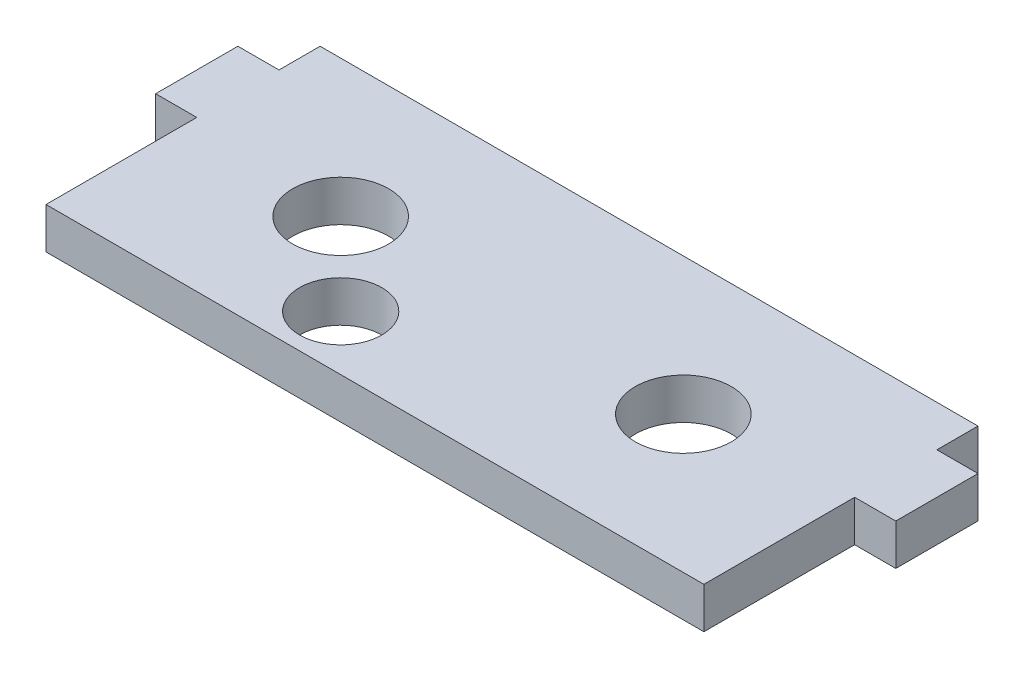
from build123d import *

# Parameters (mm, degrees)
SKETCH1_W           = 48
SKETCH1_H           = 20
BOSS_EXTRUDE1_DEPTH = 3
SKETCH2_W           = 3
SKETCH2_H           = 6
BOSS_EXTRUDE2_DEPTH = 3
SKETCH3_R           = 3
SKETCH3_R_2         = 3.5
CUT_EXTRUDE1_DEPTH  = 3


with BuildPart() as part:
    # Sketch1 → Boss-Extrude1 (new body)
    with BuildSketch(Plane(origin=(0, 0, 0), x_dir=(1, 0, 0), z_dir=(0, 1, 0))):
        Rectangle(SKETCH1_W, SKETCH1_H)
    extrude(amount=BOSS_EXTRUDE1_DEPTH)

    # Sketch2 → Boss-Extrude2 (add)
    with BuildSketch(Plane(origin=(0, 0, 0), x_dir=(1, 0, 0), z_dir=(0, 1, 0))):
        with Locations((-25.5, 4)):
            Rectangle(SKETCH2_W, SKETCH2_H)
        with Locations((25.5, 4)):
            Rectangle(SKETCH2_W, SKETCH2_H)
    extrude(amount=BOSS_EXTRUDE2_DEPTH)

    # Sketch3 → Cut-Extrude1 (cut)
    with BuildSketch(Plane(origin=(0, 0, 0), x_dir=(1, 0, 0), z_dir=(0, 1, 0))):
        with Locations(Location((-6.5, -6, 0), (0, 0, 270))):
            Circle(SKETCH3_R)
        with Locations(Location((-12.5, 0, 0), (0, 0, 270))):
            Circle(SKETCH3_R_2)
        with Locations(Location((12.5, 0, 0), (0, 0, 270))):
            Circle(SKETCH3_R_2)
    extrude(amount=CUT_EXTRUDE1_DEPTH, mode=Mode.SUBTRACT)


solid = part.part
